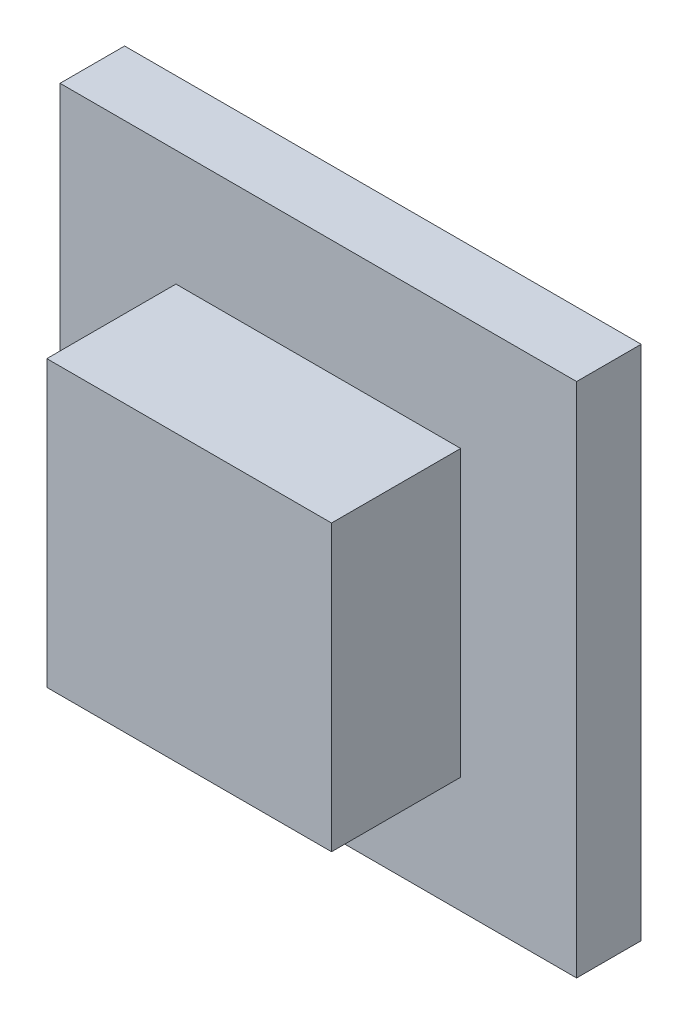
from build123d import *

# Parameters (mm, degrees)
SKETCH1_W           = 6.35
SKETCH1_H           = 6.35
BOSS_EXTRUDE1_DEPTH = 0.79375
SKETCH2_W           = 3.5
SKETCH2_H           = 3.5
BOSS_EXTRUDE2_DEPTH = 1.5875


with BuildPart() as part:
    # Sketch1 → Boss-Extrude1 (new body)
    with BuildSketch(Plane.XY):
        Rectangle(SKETCH1_W, SKETCH1_H)
    extrude(amount=-BOSS_EXTRUDE1_DEPTH)

    # Sketch2 → Boss-Extrude2 (add)
    with BuildSketch(Plane.XY):
        Rectangle(SKETCH2_W, SKETCH2_H)
    extrude(amount=BOSS_EXTRUDE2_DEPTH)


solid = part.part
